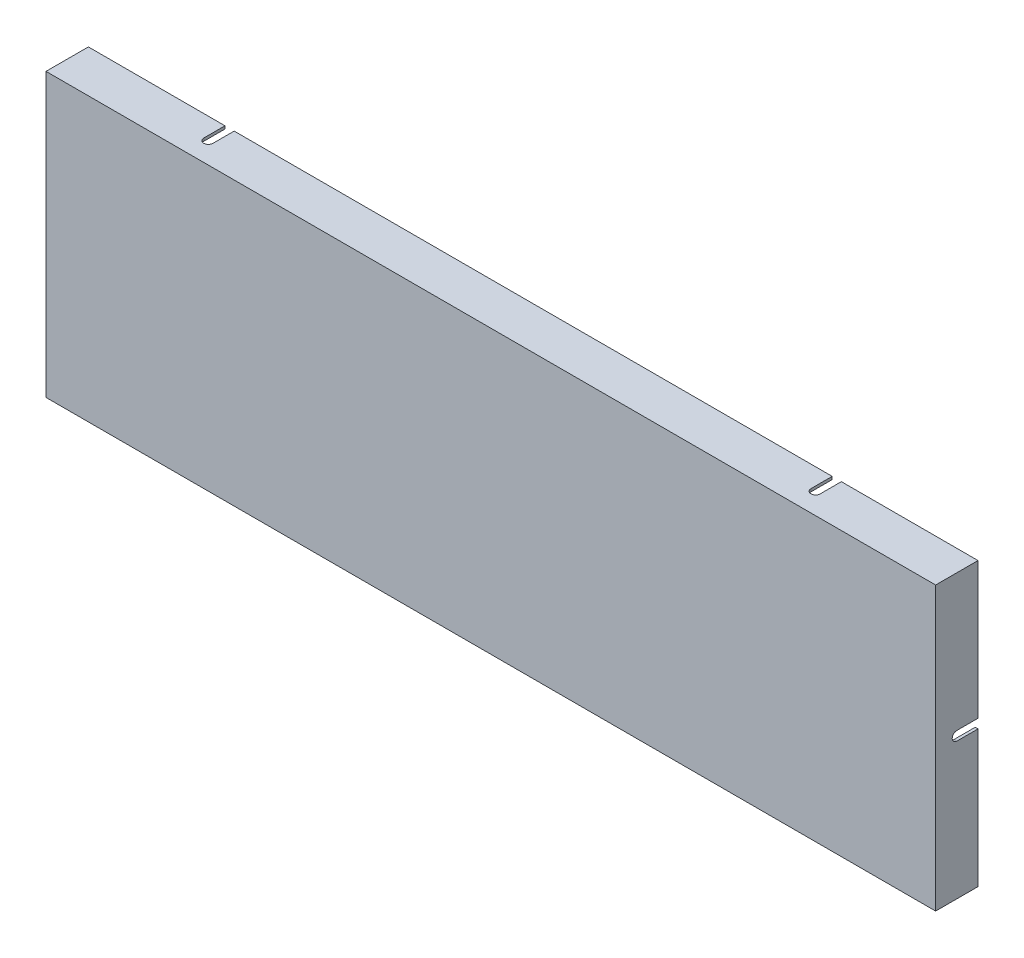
from build123d import *

# Parameters (mm, degrees)
SKETCH_1_W          = 630
SKETCH_1_H          = 200
EXTRUDE_1_DEPTH     = 30
SHELL_2_T           = -2
CUT_EXTRUDE_2_DEPTH = 662.664567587
CUT_EXTRUDE_3_DEPTH = 662.664567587


with BuildPart() as part:
    # Sketch 1 → Extrude 1 (new body)
    with BuildSketch(Plane.XY):
        with Locations((315, -100)):
            Rectangle(SKETCH_1_W, SKETCH_1_H)
    extrude(amount=EXTRUDE_1_DEPTH)

    # Shell 2
    shell_2_openings = [part.faces().sort_by_distance(p)[0] for p in [
        (315, -100, 0),
    ]]
    offset(amount=SHELL_2_T, openings=shell_2_openings, kind=Kind.INTERSECTION)

    # Sketch 5 → Cut-Extrude 2 (cut, through all)
    with BuildSketch(Plane(origin=(0, 0, 0), x_dir=(1, 0, 0), z_dir=(0, 1, 0))):
        with BuildLine():
            Line((103.25, 0), (103.25, -15))
            ThreePointArc((103.25, -15), (100, -18.25), (96.75, -15))
            Line((96.75, -15), (96.75, 0))
            ThreePointArc((96.75, 0), (100, 3.25), (103.25, 0))
        make_face()
        with BuildLine():
            Line((533.25, 0), (533.25, -15))
            ThreePointArc((533.25, -15), (530, -18.25), (526.75, -15))
            Line((526.75, -15), (526.75, 0))
            ThreePointArc((526.75, 0), (530, 3.25), (533.25, 0))
        make_face()
    extrude(amount=-CUT_EXTRUDE_2_DEPTH, mode=Mode.SUBTRACT)

    # Sketch 6 → Cut-Extrude 3 (cut, through all)
    with BuildSketch(Plane.ZY):
        with BuildLine():
            Line((0, -96.75), (15, -96.75))
            ThreePointArc((15, -96.75), (18.25, -100), (15, -103.25))
            Line((15, -103.25), (0, -103.25))
            ThreePointArc((0, -103.25), (-3.25, -100), (0, -96.75))
        make_face()
    extrude(amount=-CUT_EXTRUDE_3_DEPTH, mode=Mode.SUBTRACT)


solid = part.part
